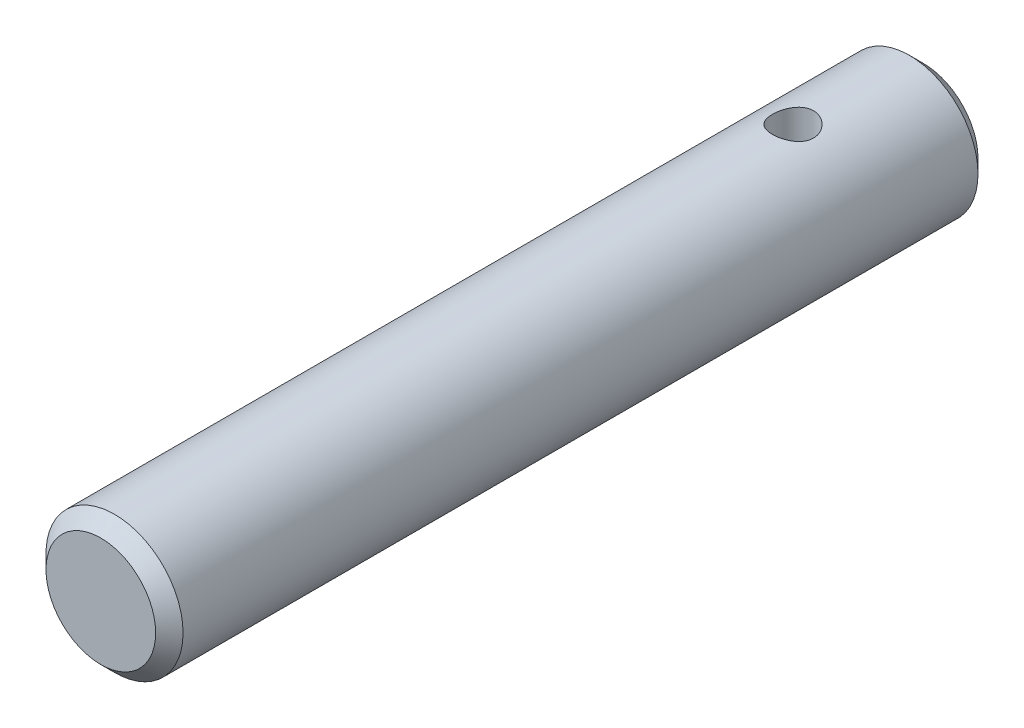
ISO-10303-21;
HEADER;
FILE_DESCRIPTION(('STEP AP214'),'2;1');
FILE_NAME('part.step','',(''),(''),'','','');
FILE_SCHEMA(('AUTOMOTIVE_DESIGN { 1 0 10303 214 1 1 1 1 }'));
ENDSEC;
DATA;
#1=APPLICATION_CONTEXT('core data for automotive mechanical design processes');
#2=APPLICATION_PROTOCOL_DEFINITION('international standard','automotive_design',2000,#1);
#3=PRODUCT_CONTEXT('',#1,'mechanical');
#4=PRODUCT('Part','Part','',(#3));
#5=PRODUCT_RELATED_PRODUCT_CATEGORY('part','',(#4));
#6=PRODUCT_DEFINITION_FORMATION('','',#4);
#7=PRODUCT_DEFINITION_CONTEXT('part definition',#1,'design');
#8=PRODUCT_DEFINITION('design','',#6,#7);
#9=PRODUCT_DEFINITION_SHAPE('','',#8);
#10=(LENGTH_UNIT() NAMED_UNIT(*) SI_UNIT(.MILLI.,.METRE.));
#11=(NAMED_UNIT(*) PLANE_ANGLE_UNIT() SI_UNIT($,.RADIAN.));
#12=(NAMED_UNIT(*) SI_UNIT($,.STERADIAN.) SOLID_ANGLE_UNIT());
#13=UNCERTAINTY_MEASURE_WITH_UNIT(LENGTH_MEASURE(1.E-05),#10,'distance_accuracy_value','');
#14=(GEOMETRIC_REPRESENTATION_CONTEXT(3) GLOBAL_UNCERTAINTY_ASSIGNED_CONTEXT((#13)) GLOBAL_UNIT_ASSIGNED_CONTEXT((#10,
#11,#12)) REPRESENTATION_CONTEXT('',''));
#15=CARTESIAN_POINT('',(0.,0.,0.));
#16=DIRECTION('',(0.,0.,1.));
#17=DIRECTION('',(1.,0.,0.));
#18=AXIS2_PLACEMENT_3D('',#15,#16,#17);
#19=CARTESIAN_POINT('',(0.,0.,120.));
#20=DIRECTION('',(0.,0.,-1.));
#21=DIRECTION('',(-1.,0.,0.));
#22=AXIS2_PLACEMENT_3D('',#19,#20,#21);
#23=CYLINDRICAL_SURFACE('',#22,10.);
#24=CARTESIAN_POINT('',(0.,-10.,22.));
#25=CARTESIAN_POINT('',(0.1645772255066,-9.99999858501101,21.9999980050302));
#26=CARTESIAN_POINT('',(0.329174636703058,-9.99589831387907,21.9864122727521));
#27=CARTESIAN_POINT('',(0.653576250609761,-9.97994211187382,21.9325572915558));
#28=CARTESIAN_POINT('',(0.81337900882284,-9.96808386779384,21.8922800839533));
#29=CARTESIAN_POINT('',(1.12346541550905,-9.93791105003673,21.7865079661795));
#30=CARTESIAN_POINT('',(1.27376272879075,-9.91960600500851,21.7210502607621));
#31=CARTESIAN_POINT('',(1.56124836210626,-9.87844218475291,21.5669278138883));
#32=CARTESIAN_POINT('',(1.69843493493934,-9.85558280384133,21.4782599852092));
#33=CARTESIAN_POINT('',(1.95974359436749,-9.80701474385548,21.2775519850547));
#34=CARTESIAN_POINT('',(2.08343614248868,-9.78124767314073,21.1649667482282));
#35=CARTESIAN_POINT('',(2.31049841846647,-9.73011668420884,20.9207815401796));
#36=CARTESIAN_POINT('',(2.41386472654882,-9.70475283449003,20.7891783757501));
#37=CARTESIAN_POINT('',(2.59960075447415,-9.65668227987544,20.5070584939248));
#38=CARTESIAN_POINT('',(2.68144618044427,-9.63404813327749,20.3561830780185));
#39=CARTESIAN_POINT('',(2.81842789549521,-9.59487240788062,20.0420214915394));
#40=CARTESIAN_POINT('',(2.87357059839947,-9.57832936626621,19.8787383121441));
#41=CARTESIAN_POINT('',(2.95403267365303,-9.55381741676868,19.5492194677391));
#42=CARTESIAN_POINT('',(2.98014392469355,-9.54562138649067,19.3831945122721));
#43=CARTESIAN_POINT('',(3.00427461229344,-9.53805579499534,19.0489336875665));
#44=CARTESIAN_POINT('',(3.00230085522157,-9.53868409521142,18.8806983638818));
#45=CARTESIAN_POINT('',(2.97093954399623,-9.54849488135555,18.553232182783));
#46=CARTESIAN_POINT('',(2.9425441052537,-9.55736777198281,18.3938954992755));
#47=CARTESIAN_POINT('',(2.86074840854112,-9.58216712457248,18.0823604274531));
#48=CARTESIAN_POINT('',(2.80734568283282,-9.59809428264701,17.9301627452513));
#49=CARTESIAN_POINT('',(2.67632053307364,-9.63545466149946,17.6347993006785));
#50=CARTESIAN_POINT('',(2.59837633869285,-9.65696032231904,17.4917858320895));
#51=CARTESIAN_POINT('',(2.42070445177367,-9.70301974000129,17.2205359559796));
#52=CARTESIAN_POINT('',(2.32097148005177,-9.72757423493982,17.0923031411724));
#53=CARTESIAN_POINT('',(2.09762581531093,-9.77822022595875,16.848627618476));
#54=CARTESIAN_POINT('',(1.97318981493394,-9.80433308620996,16.7339426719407));
#55=CARTESIAN_POINT('',(1.70652651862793,-9.85424488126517,16.5268920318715));
#56=CARTESIAN_POINT('',(1.56429810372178,-9.8780436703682,16.4345277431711));
#57=CARTESIAN_POINT('',(1.26471007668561,-9.92086320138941,16.2742801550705));
#58=CARTESIAN_POINT('',(1.1072554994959,-9.93985087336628,16.2065649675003));
#59=CARTESIAN_POINT('',(0.78249083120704,-9.97067043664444,16.0988008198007));
#60=CARTESIAN_POINT('',(0.615183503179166,-9.98250432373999,16.058744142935));
#61=CARTESIAN_POINT('',(0.281904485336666,-9.99736729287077,16.0086956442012));
#62=CARTESIAN_POINT('',(0.116100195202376,-10.0006970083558,15.9976768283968));
#63=CARTESIAN_POINT('',(-0.214999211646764,-9.99905846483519,16.0031383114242));
#64=CARTESIAN_POINT('',(-0.38029439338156,-9.99409131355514,16.0196149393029));
#65=CARTESIAN_POINT('',(-0.701807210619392,-9.97661393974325,16.078769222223));
#66=CARTESIAN_POINT('',(-0.858145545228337,-9.96427659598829,16.1208467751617));
#67=CARTESIAN_POINT('',(-1.16150927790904,-9.9334869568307,16.2292864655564));
#68=CARTESIAN_POINT('',(-1.30853355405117,-9.91503392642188,16.2956515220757));
#69=CARTESIAN_POINT('',(-1.5928743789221,-9.87339308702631,16.4525063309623));
#70=CARTESIAN_POINT('',(-1.72988765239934,-9.8501056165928,16.543518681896));
#71=CARTESIAN_POINT('',(-1.9870466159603,-9.80146937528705,16.7464495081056));
#72=CARTESIAN_POINT('',(-2.10718806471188,-9.7761200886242,16.8583732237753));
#73=CARTESIAN_POINT('',(-2.33171489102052,-9.72506343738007,17.1047746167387));
#74=CARTESIAN_POINT('',(-2.43536962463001,-9.69937650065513,17.2399237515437));
#75=CARTESIAN_POINT('',(-2.61857990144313,-9.65153030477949,17.5262558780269));
#76=CARTESIAN_POINT('',(-2.69813607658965,-9.62937095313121,17.6774384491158));
#77=CARTESIAN_POINT('',(-2.83034694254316,-9.5913437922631,17.99106498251));
#78=CARTESIAN_POINT('',(-2.88312693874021,-9.57544675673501,18.1534523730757));
#79=CARTESIAN_POINT('',(-2.96043461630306,-9.55183188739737,18.4853759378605));
#80=CARTESIAN_POINT('',(-2.98497197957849,-9.54411125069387,18.6549096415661));
#81=CARTESIAN_POINT('',(-3.0044396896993,-9.53799944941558,18.9887230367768));
#82=CARTESIAN_POINT('',(-3.00056110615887,-9.53923294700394,19.1529273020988));
#83=CARTESIAN_POINT('',(-2.9661501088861,-9.54998802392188,19.4782282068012));
#84=CARTESIAN_POINT('',(-2.93561876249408,-9.55950927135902,19.639324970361));
#85=CARTESIAN_POINT('',(-2.84953777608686,-9.58551527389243,19.9518907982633));
#86=CARTESIAN_POINT('',(-2.79430351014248,-9.60191209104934,20.1034545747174));
#87=CARTESIAN_POINT('',(-2.66063014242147,-9.63980557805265,20.3952848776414));
#88=CARTESIAN_POINT('',(-2.58218659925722,-9.6613032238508,20.5355492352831));
#89=CARTESIAN_POINT('',(-2.40097527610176,-9.70795352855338,20.8063262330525));
#90=CARTESIAN_POINT('',(-2.29742552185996,-9.7332108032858,20.9362975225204));
#91=CARTESIAN_POINT('',(-2.07034869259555,-9.78402640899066,21.1774049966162));
#92=CARTESIAN_POINT('',(-1.94681643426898,-9.80958481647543,21.2885362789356));
#93=CARTESIAN_POINT('',(-1.67893152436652,-9.85901873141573,21.4920468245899));
#94=CARTESIAN_POINT('',(-1.53407577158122,-9.88282319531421,21.5837828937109));
#95=CARTESIAN_POINT('',(-1.23028274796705,-9.92521360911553,21.7414703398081));
#96=CARTESIAN_POINT('',(-1.07135210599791,-9.94380199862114,21.807433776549));
#97=CARTESIAN_POINT('',(-0.761515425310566,-9.97204349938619,21.9057905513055));
#98=CARTESIAN_POINT('',(-0.61157392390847,-9.9824405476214,21.9410233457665));
#99=CARTESIAN_POINT('',(-0.307760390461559,-9.9964188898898,21.9881270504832));
#100=CARTESIAN_POINT('',(-0.153889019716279,-10.0000013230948,22.0000018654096));
#101=CARTESIAN_POINT('',(0.,-10.,22.));
#102=B_SPLINE_CURVE_WITH_KNOTS('',3,(#24,#25,#26,#27,#28,#29,#30,#31,#32,#33,#34,#35,#36,#37,
#38,#39,#40,#41,#42,#43,#44,#45,#46,#47,#48,#49,#50,#51,#52,#53,#54,#55,#56,#57,#58,#59,#60,#61,
#62,#63,#64,#65,#66,#67,#68,#69,#70,#71,#72,#73,#74,#75,#76,#77,#78,#79,#80,#81,#82,#83,#84,#85,
#86,#87,#88,#89,#90,#91,#92,#93,#94,#95,#96,#97,#98,#99,#100,#101),.UNSPECIFIED.,.T.,.F.,(4,2,2,
2,2,2,2,2,2,2,2,2,2,2,2,2,2,2,2,2,2,2,2,2,2,2,2,2,2,2,2,2,2,2,2,2,2,2,4),(0.,0.493166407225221,
0.986479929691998,1.47906735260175,1.9717203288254,2.47711205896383,2.98258874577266,
3.49942962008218,4.01614629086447,4.51839378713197,5.02051956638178,5.50452033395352,
5.98856887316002,6.47924852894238,6.97004720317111,7.48134208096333,7.99266913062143,
8.50742093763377,9.02202907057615,9.5181761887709,10.0142570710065,10.4991349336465,
10.9840710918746,11.4802261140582,11.9765056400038,12.4908080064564,13.0050968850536,
13.516956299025,14.0286401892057,14.5190031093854,15.0093463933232,15.4936008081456,
15.9779479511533,16.4799385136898,16.9820594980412,17.4988599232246,18.0154182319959,
18.4766338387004,18.9377723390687),.UNSPECIFIED.);
#103=CARTESIAN_POINT('',(0.,-10.,22.));
#104=VERTEX_POINT('',#103);
#105=EDGE_CURVE('E10',#104,#104,#102,.T.);
#106=ORIENTED_EDGE('',*,*,#105,.T.);
#107=EDGE_LOOP('',(#106));
#108=FACE_BOUND('',#107,.T.);
#109=CARTESIAN_POINT('',(0.,10.,22.));
#110=CARTESIAN_POINT('',(-0.1645772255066,9.99999858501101,21.9999980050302));
#111=CARTESIAN_POINT('',(-0.329174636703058,9.99589831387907,21.9864122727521));
#112=CARTESIAN_POINT('',(-0.653576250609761,9.97994211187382,21.9325572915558));
#113=CARTESIAN_POINT('',(-0.81337900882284,9.96808386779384,21.8922800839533));
#114=CARTESIAN_POINT('',(-1.12346541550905,9.93791105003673,21.7865079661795));
#115=CARTESIAN_POINT('',(-1.27376272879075,9.91960600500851,21.7210502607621));
#116=CARTESIAN_POINT('',(-1.56124836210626,9.87844218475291,21.5669278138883));
#117=CARTESIAN_POINT('',(-1.69843493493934,9.85558280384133,21.4782599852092));
#118=CARTESIAN_POINT('',(-1.95974359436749,9.80701474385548,21.2775519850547));
#119=CARTESIAN_POINT('',(-2.08343614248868,9.78124767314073,21.1649667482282));
#120=CARTESIAN_POINT('',(-2.31049841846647,9.73011668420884,20.9207815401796));
#121=CARTESIAN_POINT('',(-2.41386472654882,9.70475283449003,20.7891783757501));
#122=CARTESIAN_POINT('',(-2.59960075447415,9.65668227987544,20.5070584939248));
#123=CARTESIAN_POINT('',(-2.68144618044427,9.63404813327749,20.3561830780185));
#124=CARTESIAN_POINT('',(-2.81842789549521,9.59487240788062,20.0420214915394));
#125=CARTESIAN_POINT('',(-2.87357059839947,9.57832936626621,19.8787383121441));
#126=CARTESIAN_POINT('',(-2.95403267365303,9.55381741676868,19.5492194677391));
#127=CARTESIAN_POINT('',(-2.98014392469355,9.54562138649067,19.3831945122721));
#128=CARTESIAN_POINT('',(-3.00427461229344,9.53805579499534,19.0489336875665));
#129=CARTESIAN_POINT('',(-3.00230085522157,9.53868409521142,18.8806983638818));
#130=CARTESIAN_POINT('',(-2.97093954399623,9.54849488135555,18.553232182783));
#131=CARTESIAN_POINT('',(-2.9425441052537,9.55736777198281,18.3938954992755));
#132=CARTESIAN_POINT('',(-2.86074840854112,9.58216712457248,18.0823604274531));
#133=CARTESIAN_POINT('',(-2.80734568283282,9.59809428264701,17.9301627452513));
#134=CARTESIAN_POINT('',(-2.67632053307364,9.63545466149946,17.6347993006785));
#135=CARTESIAN_POINT('',(-2.59837633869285,9.65696032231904,17.4917858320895));
#136=CARTESIAN_POINT('',(-2.42070445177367,9.70301974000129,17.2205359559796));
#137=CARTESIAN_POINT('',(-2.32097148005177,9.72757423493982,17.0923031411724));
#138=CARTESIAN_POINT('',(-2.09762581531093,9.77822022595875,16.848627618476));
#139=CARTESIAN_POINT('',(-1.97318981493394,9.80433308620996,16.7339426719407));
#140=CARTESIAN_POINT('',(-1.70652651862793,9.85424488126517,16.5268920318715));
#141=CARTESIAN_POINT('',(-1.56429810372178,9.8780436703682,16.4345277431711));
#142=CARTESIAN_POINT('',(-1.26471007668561,9.92086320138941,16.2742801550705));
#143=CARTESIAN_POINT('',(-1.1072554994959,9.93985087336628,16.2065649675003));
#144=CARTESIAN_POINT('',(-0.78249083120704,9.97067043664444,16.0988008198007));
#145=CARTESIAN_POINT('',(-0.615183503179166,9.98250432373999,16.058744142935));
#146=CARTESIAN_POINT('',(-0.281904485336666,9.99736729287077,16.0086956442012));
#147=CARTESIAN_POINT('',(-0.116100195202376,10.0006970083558,15.9976768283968));
#148=CARTESIAN_POINT('',(0.214999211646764,9.99905846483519,16.0031383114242));
#149=CARTESIAN_POINT('',(0.38029439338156,9.99409131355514,16.0196149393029));
#150=CARTESIAN_POINT('',(0.701807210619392,9.97661393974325,16.078769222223));
#151=CARTESIAN_POINT('',(0.858145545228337,9.96427659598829,16.1208467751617));
#152=CARTESIAN_POINT('',(1.16150927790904,9.9334869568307,16.2292864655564));
#153=CARTESIAN_POINT('',(1.30853355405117,9.91503392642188,16.2956515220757));
#154=CARTESIAN_POINT('',(1.5928743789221,9.87339308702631,16.4525063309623));
#155=CARTESIAN_POINT('',(1.72988765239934,9.8501056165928,16.543518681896));
#156=CARTESIAN_POINT('',(1.9870466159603,9.80146937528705,16.7464495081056));
#157=CARTESIAN_POINT('',(2.10718806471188,9.7761200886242,16.8583732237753));
#158=CARTESIAN_POINT('',(2.33171489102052,9.72506343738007,17.1047746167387));
#159=CARTESIAN_POINT('',(2.43536962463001,9.69937650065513,17.2399237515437));
#160=CARTESIAN_POINT('',(2.61857990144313,9.65153030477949,17.5262558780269));
#161=CARTESIAN_POINT('',(2.69813607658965,9.62937095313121,17.6774384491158));
#162=CARTESIAN_POINT('',(2.83034694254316,9.5913437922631,17.99106498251));
#163=CARTESIAN_POINT('',(2.88312693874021,9.57544675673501,18.1534523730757));
#164=CARTESIAN_POINT('',(2.96043461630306,9.55183188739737,18.4853759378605));
#165=CARTESIAN_POINT('',(2.98497197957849,9.54411125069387,18.6549096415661));
#166=CARTESIAN_POINT('',(3.0044396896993,9.53799944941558,18.9887230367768));
#167=CARTESIAN_POINT('',(3.00056110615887,9.53923294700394,19.1529273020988));
#168=CARTESIAN_POINT('',(2.9661501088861,9.54998802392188,19.4782282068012));
#169=CARTESIAN_POINT('',(2.93561876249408,9.55950927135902,19.639324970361));
#170=CARTESIAN_POINT('',(2.84953777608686,9.58551527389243,19.9518907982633));
#171=CARTESIAN_POINT('',(2.79430351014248,9.60191209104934,20.1034545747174));
#172=CARTESIAN_POINT('',(2.66063014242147,9.63980557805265,20.3952848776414));
#173=CARTESIAN_POINT('',(2.58218659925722,9.6613032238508,20.5355492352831));
#174=CARTESIAN_POINT('',(2.40097527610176,9.70795352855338,20.8063262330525));
#175=CARTESIAN_POINT('',(2.29742552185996,9.7332108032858,20.9362975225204));
#176=CARTESIAN_POINT('',(2.07034869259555,9.78402640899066,21.1774049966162));
#177=CARTESIAN_POINT('',(1.94681643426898,9.80958481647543,21.2885362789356));
#178=CARTESIAN_POINT('',(1.67893152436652,9.85901873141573,21.4920468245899));
#179=CARTESIAN_POINT('',(1.53407577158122,9.88282319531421,21.5837828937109));
#180=CARTESIAN_POINT('',(1.23028274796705,9.92521360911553,21.7414703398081));
#181=CARTESIAN_POINT('',(1.07135210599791,9.94380199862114,21.807433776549));
#182=CARTESIAN_POINT('',(0.761515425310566,9.97204349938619,21.9057905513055));
#183=CARTESIAN_POINT('',(0.61157392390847,9.9824405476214,21.9410233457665));
#184=CARTESIAN_POINT('',(0.307760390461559,9.9964188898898,21.9881270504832));
#185=CARTESIAN_POINT('',(0.153889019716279,10.0000013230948,22.0000018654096));
#186=CARTESIAN_POINT('',(0.,10.,22.));
#187=B_SPLINE_CURVE_WITH_KNOTS('',3,(#109,#110,#111,#112,#113,#114,#115,#116,#117,#118,#119,
#120,#121,#122,#123,#124,#125,#126,#127,#128,#129,#130,#131,#132,#133,#134,#135,#136,#137,#138,
#139,#140,#141,#142,#143,#144,#145,#146,#147,#148,#149,#150,#151,#152,#153,#154,#155,#156,#157,
#158,#159,#160,#161,#162,#163,#164,#165,#166,#167,#168,#169,#170,#171,#172,#173,#174,#175,#176,
#177,#178,#179,#180,#181,#182,#183,#184,#185,#186),.UNSPECIFIED.,.T.,.F.,(4,2,2,2,2,2,2,2,2,2,2,
2,2,2,2,2,2,2,2,2,2,2,2,2,2,2,2,2,2,2,2,2,2,2,2,2,2,2,4),(0.,0.493166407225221,
0.986479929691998,1.47906735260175,1.9717203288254,2.47711205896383,2.98258874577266,
3.49942962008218,4.01614629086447,4.51839378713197,5.02051956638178,5.50452033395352,
5.98856887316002,6.47924852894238,6.97004720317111,7.48134208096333,7.99266913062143,
8.50742093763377,9.02202907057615,9.5181761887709,10.0142570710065,10.4991349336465,
10.9840710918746,11.4802261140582,11.9765056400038,12.4908080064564,13.0050968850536,
13.516956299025,14.0286401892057,14.5190031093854,15.0093463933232,15.4936008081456,
15.9779479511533,16.4799385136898,16.9820594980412,17.4988599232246,18.0154182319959,
18.4766338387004,18.9377723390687),.UNSPECIFIED.);
#188=CARTESIAN_POINT('',(0.,10.,22.));
#189=VERTEX_POINT('',#188);
#190=EDGE_CURVE('E41',#189,#189,#187,.T.);
#191=ORIENTED_EDGE('',*,*,#190,.T.);
#192=EDGE_LOOP('',(#191));
#193=FACE_BOUND('',#192,.T.);
#194=CARTESIAN_POINT('',(0.,0.,1.99999999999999));
#195=DIRECTION('',(0.,0.,1.));
#196=DIRECTION('',(1.,0.,0.));
#197=AXIS2_PLACEMENT_3D('',#194,#195,#196);
#198=CIRCLE('',#197,10.);
#199=CARTESIAN_POINT('',(10.,0.,1.99999999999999));
#200=VERTEX_POINT('',#199);
#201=EDGE_CURVE('E85',#200,#200,#198,.T.);
#202=ORIENTED_EDGE('',*,*,#201,.T.);
#203=EDGE_LOOP('',(#202));
#204=FACE_BOUND('',#203,.T.);
#205=CARTESIAN_POINT('',(0.,0.,118.));
#206=DIRECTION('',(0.,0.,1.));
#207=DIRECTION('',(1.,0.,0.));
#208=AXIS2_PLACEMENT_3D('',#205,#206,#207);
#209=CIRCLE('',#208,10.);
#210=CARTESIAN_POINT('',(10.,0.,118.));
#211=VERTEX_POINT('',#210);
#212=EDGE_CURVE('E88',#211,#211,#209,.F.);
#213=ORIENTED_EDGE('',*,*,#212,.T.);
#214=EDGE_LOOP('',(#213));
#215=FACE_BOUND('',#214,.T.);
#216=ADVANCED_FACE('F31',(#108,#193,#204,#215),#23,.T.);
#217=CARTESIAN_POINT('',(0.,0.,120.));
#218=DIRECTION('',(0.,0.,1.));
#219=DIRECTION('',(1.,0.,0.));
#220=AXIS2_PLACEMENT_3D('',#217,#218,#219);
#221=PLANE('',#220);
#222=CARTESIAN_POINT('',(0.,0.,120.));
#223=DIRECTION('',(0.,0.,1.));
#224=DIRECTION('',(1.,0.,0.));
#225=AXIS2_PLACEMENT_3D('',#222,#223,#224);
#226=CIRCLE('',#225,7.99999999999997);
#227=CARTESIAN_POINT('',(7.99999999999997,0.,120.));
#228=VERTEX_POINT('',#227);
#229=EDGE_CURVE('E45',#228,#228,#226,.T.);
#230=ORIENTED_EDGE('',*,*,#229,.T.);
#231=EDGE_LOOP('',(#230));
#232=FACE_BOUND('',#231,.T.);
#233=ADVANCED_FACE('F70',(#232),#221,.T.);
#234=CARTESIAN_POINT('',(0.,0.,0.));
#235=DIRECTION('',(0.,0.,1.));
#236=DIRECTION('',(1.,0.,0.));
#237=AXIS2_PLACEMENT_3D('',#234,#235,#236);
#238=PLANE('',#237);
#239=CARTESIAN_POINT('',(0.,0.,0.));
#240=DIRECTION('',(0.,0.,1.));
#241=DIRECTION('',(1.,0.,0.));
#242=AXIS2_PLACEMENT_3D('',#239,#240,#241);
#243=CIRCLE('',#242,8.00000000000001);
#244=CARTESIAN_POINT('',(8.00000000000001,0.,0.));
#245=VERTEX_POINT('',#244);
#246=EDGE_CURVE('E49',#245,#245,#243,.F.);
#247=ORIENTED_EDGE('',*,*,#246,.T.);
#248=EDGE_LOOP('',(#247));
#249=FACE_BOUND('',#248,.T.);
#250=ADVANCED_FACE('F67',(#249),#238,.F.);
#251=CARTESIAN_POINT('',(0.,0.,1.99999999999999));
#252=DIRECTION('',(0.,0.,1.));
#253=DIRECTION('',(1.,0.,0.));
#254=AXIS2_PLACEMENT_3D('',#251,#252,#253);
#255=CONICAL_SURFACE('',#254,10.,0.78539816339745);
#256=ORIENTED_EDGE('',*,*,#246,.F.);
#257=EDGE_LOOP('',(#256));
#258=FACE_BOUND('',#257,.T.);
#259=ORIENTED_EDGE('',*,*,#201,.F.);
#260=EDGE_LOOP('',(#259));
#261=FACE_BOUND('',#260,.T.);
#262=ADVANCED_FACE('F63',(#258,#261),#255,.T.);
#263=CARTESIAN_POINT('',(0.,0.,120.));
#264=DIRECTION('',(0.,0.,-1.));
#265=DIRECTION('',(-1.,0.,0.));
#266=AXIS2_PLACEMENT_3D('',#263,#264,#265);
#267=CONICAL_SURFACE('',#266,7.99999999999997,0.785398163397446);
#268=ORIENTED_EDGE('',*,*,#212,.F.);
#269=EDGE_LOOP('',(#268));
#270=FACE_BOUND('',#269,.T.);
#271=ORIENTED_EDGE('',*,*,#229,.F.);
#272=EDGE_LOOP('',(#271));
#273=FACE_BOUND('',#272,.T.);
#274=ADVANCED_FACE('F58',(#270,#273),#267,.T.);
#275=CARTESIAN_POINT('',(0.,-10.,19.));
#276=DIRECTION('',(0.,1.,0.));
#277=DIRECTION('',(0.,0.,1.));
#278=AXIS2_PLACEMENT_3D('',#275,#276,#277);
#279=CYLINDRICAL_SURFACE('',#278,3.);
#280=ORIENTED_EDGE('',*,*,#190,.F.);
#281=EDGE_LOOP('',(#280));
#282=FACE_BOUND('',#281,.T.);
#283=ORIENTED_EDGE('',*,*,#105,.F.);
#284=EDGE_LOOP('',(#283));
#285=FACE_BOUND('',#284,.T.);
#286=ADVANCED_FACE('F54',(#282,#285),#279,.F.);
#287=CLOSED_SHELL('',(#216,#233,#250,#262,#274,#286));
#288=MANIFOLD_SOLID_BREP('B2',#287);
#289=ADVANCED_BREP_SHAPE_REPRESENTATION('',(#18,#288),#14);
#290=SHAPE_DEFINITION_REPRESENTATION(#9,#289);
ENDSEC;
END-ISO-10303-21;
